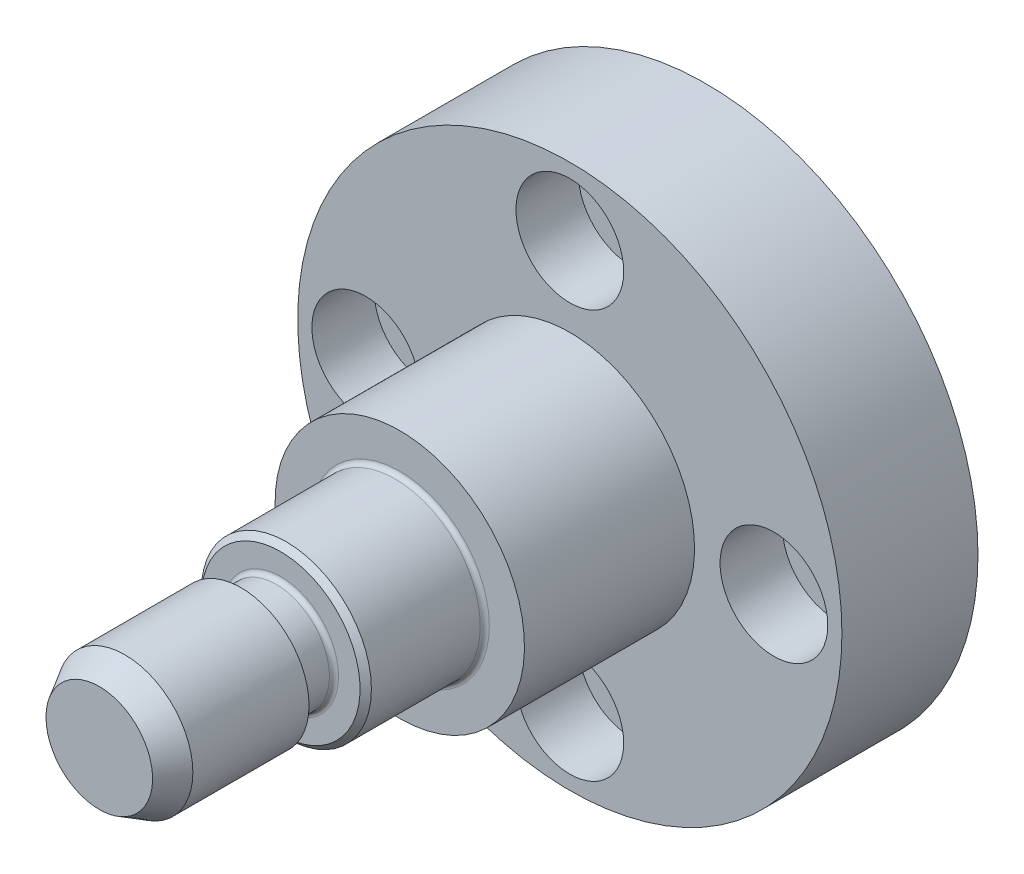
ISO-10303-21;
HEADER;
FILE_DESCRIPTION(('STEP AP214'),'2;1');
FILE_NAME('part.step','',(''),(''),'','','');
FILE_SCHEMA(('AUTOMOTIVE_DESIGN { 1 0 10303 214 1 1 1 1 }'));
ENDSEC;
DATA;
#1=APPLICATION_CONTEXT('core data for automotive mechanical design processes');
#2=APPLICATION_PROTOCOL_DEFINITION('international standard','automotive_design',2000,#1);
#3=PRODUCT_CONTEXT('',#1,'mechanical');
#4=PRODUCT('Part','Part','',(#3));
#5=PRODUCT_RELATED_PRODUCT_CATEGORY('part','',(#4));
#6=PRODUCT_DEFINITION_FORMATION('','',#4);
#7=PRODUCT_DEFINITION_CONTEXT('part definition',#1,'design');
#8=PRODUCT_DEFINITION('design','',#6,#7);
#9=PRODUCT_DEFINITION_SHAPE('','',#8);
#10=(LENGTH_UNIT() NAMED_UNIT(*) SI_UNIT(.MILLI.,.METRE.));
#11=(NAMED_UNIT(*) PLANE_ANGLE_UNIT() SI_UNIT($,.RADIAN.));
#12=(NAMED_UNIT(*) SI_UNIT($,.STERADIAN.) SOLID_ANGLE_UNIT());
#13=UNCERTAINTY_MEASURE_WITH_UNIT(LENGTH_MEASURE(1.E-05),#10,'distance_accuracy_value','');
#14=(GEOMETRIC_REPRESENTATION_CONTEXT(3) GLOBAL_UNCERTAINTY_ASSIGNED_CONTEXT((#13)) GLOBAL_UNIT_ASSIGNED_CONTEXT((#10,
#11,#12)) REPRESENTATION_CONTEXT('',''));
#15=CARTESIAN_POINT('',(0.,0.,0.));
#16=DIRECTION('',(0.,0.,1.));
#17=DIRECTION('',(1.,0.,0.));
#18=AXIS2_PLACEMENT_3D('',#15,#16,#17);
#19=CARTESIAN_POINT('',(-4.7564,-4.77276662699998,53.5));
#20=DIRECTION('',(0.,0.,1.));
#21=DIRECTION('',(1.,0.,0.));
#22=AXIS2_PLACEMENT_3D('',#19,#20,#21);
#23=PLANE('',#22);
#24=CARTESIAN_POINT('',(0.,0.,53.5));
#25=DIRECTION('',(0.,0.,-1.));
#26=DIRECTION('',(-1.,0.,0.));
#27=AXIS2_PLACEMENT_3D('',#24,#25,#26);
#28=CIRCLE('',#27,4.7);
#29=CARTESIAN_POINT('',(-4.7,0.,53.5));
#30=VERTEX_POINT('',#29);
#31=EDGE_CURVE('E16',#30,#30,#28,.T.);
#32=ORIENTED_EDGE('',*,*,#31,.F.);
#33=EDGE_LOOP('',(#32));
#34=FACE_BOUND('',#33,.T.);
#35=ADVANCED_FACE('F12',(#34),#23,.T.);
#36=CARTESIAN_POINT('',(0.,0.,53.5));
#37=DIRECTION('',(0.,0.,-1.));
#38=DIRECTION('',(-1.,0.,0.));
#39=AXIS2_PLACEMENT_3D('',#36,#37,#38);
#40=CONICAL_SURFACE('',#39,4.7,0.523598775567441);
#41=ORIENTED_EDGE('',*,*,#31,.T.);
#42=EDGE_LOOP('',(#41));
#43=FACE_BOUND('',#42,.T.);
#44=CARTESIAN_POINT('',(0.,0.,51.24833395));
#45=DIRECTION('',(0.,0.,1.));
#46=DIRECTION('',(1.,0.,0.));
#47=AXIS2_PLACEMENT_3D('',#44,#45,#46);
#48=CIRCLE('',#47,6.);
#49=CARTESIAN_POINT('',(6.,0.,51.24833395));
#50=VERTEX_POINT('',#49);
#51=EDGE_CURVE('E28',#50,#50,#48,.F.);
#52=ORIENTED_EDGE('',*,*,#51,.F.);
#53=EDGE_LOOP('',(#52));
#54=FACE_BOUND('',#53,.T.);
#55=ADVANCED_FACE('F108',(#43,#54),#40,.T.);
#56=CARTESIAN_POINT('',(0.,0.,41.));
#57=DIRECTION('',(0.,0.,1.));
#58=DIRECTION('',(1.,0.,0.));
#59=AXIS2_PLACEMENT_3D('',#56,#57,#58);
#60=CYLINDRICAL_SURFACE('',#59,6.);
#61=CARTESIAN_POINT('',(0.,0.,41.));
#62=DIRECTION('',(0.,0.,1.));
#63=DIRECTION('',(1.,0.,0.));
#64=AXIS2_PLACEMENT_3D('',#61,#62,#63);
#65=CIRCLE('',#64,6.);
#66=CARTESIAN_POINT('',(6.,0.,41.));
#67=VERTEX_POINT('',#66);
#68=EDGE_CURVE('E98',#67,#67,#65,.F.);
#69=ORIENTED_EDGE('',*,*,#68,.F.);
#70=EDGE_LOOP('',(#69));
#71=FACE_BOUND('',#70,.T.);
#72=ORIENTED_EDGE('',*,*,#51,.T.);
#73=EDGE_LOOP('',(#72));
#74=FACE_BOUND('',#73,.T.);
#75=ADVANCED_FACE('F118',(#71,#74),#60,.T.);
#76=CARTESIAN_POINT('',(6.072,-6.09289356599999,41.));
#77=DIRECTION('',(0.,0.,-1.));
#78=DIRECTION('',(-1.,0.,0.));
#79=AXIS2_PLACEMENT_3D('',#76,#77,#78);
#80=PLANE('',#79);
#81=CARTESIAN_POINT('',(0.,0.,41.));
#82=DIRECTION('',(0.,0.,1.));
#83=DIRECTION('',(1.,0.,0.));
#84=AXIS2_PLACEMENT_3D('',#81,#82,#83);
#85=CIRCLE('',#84,4.7);
#86=CARTESIAN_POINT('',(4.7,0.,41.));
#87=VERTEX_POINT('',#86);
#88=EDGE_CURVE('E96',#87,#87,#85,.F.);
#89=ORIENTED_EDGE('',*,*,#88,.F.);
#90=EDGE_LOOP('',(#89));
#91=FACE_BOUND('',#90,.T.);
#92=ORIENTED_EDGE('',*,*,#68,.T.);
#93=EDGE_LOOP('',(#92));
#94=FACE_BOUND('',#93,.T.);
#95=ADVANCED_FACE('F187',(#91,#94),#80,.T.);
#96=CARTESIAN_POINT('',(0.,0.,37.9));
#97=DIRECTION('',(0.,0.,1.));
#98=DIRECTION('',(1.,0.,0.));
#99=AXIS2_PLACEMENT_3D('',#96,#97,#98);
#100=CYLINDRICAL_SURFACE('',#99,4.7);
#101=CARTESIAN_POINT('',(0.,0.,37.9));
#102=DIRECTION('',(0.,0.,1.));
#103=DIRECTION('',(1.,0.,0.));
#104=AXIS2_PLACEMENT_3D('',#101,#102,#103);
#105=CIRCLE('',#104,4.7);
#106=CARTESIAN_POINT('',(4.7,0.,37.9));
#107=VERTEX_POINT('',#106);
#108=EDGE_CURVE('E95',#107,#107,#105,.T.);
#109=ORIENTED_EDGE('',*,*,#108,.T.);
#110=EDGE_LOOP('',(#109));
#111=FACE_BOUND('',#110,.T.);
#112=ORIENTED_EDGE('',*,*,#88,.T.);
#113=EDGE_LOOP('',(#112));
#114=FACE_BOUND('',#113,.T.);
#115=ADVANCED_FACE('F183',(#111,#114),#100,.T.);
#116=CARTESIAN_POINT('',(0.,0.,37.9));
#117=DIRECTION('',(0.,0.,1.));
#118=DIRECTION('',(1.,0.,0.));
#119=AXIS2_PLACEMENT_3D('',#116,#117,#118);
#120=TOROIDAL_SURFACE('',#119,5.1,0.4);
#121=CARTESIAN_POINT('',(0.,0.,37.5));
#122=DIRECTION('',(0.,0.,1.));
#123=DIRECTION('',(1.,0.,0.));
#124=AXIS2_PLACEMENT_3D('',#121,#122,#123);
#125=CIRCLE('',#124,5.100000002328);
#126=CARTESIAN_POINT('',(5.100000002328,0.,37.5));
#127=VERTEX_POINT('',#126);
#128=EDGE_CURVE('E92',#127,#127,#125,.F.);
#129=ORIENTED_EDGE('',*,*,#128,.F.);
#130=EDGE_LOOP('',(#129));
#131=FACE_BOUND('',#130,.T.);
#132=ORIENTED_EDGE('',*,*,#108,.F.);
#133=EDGE_LOOP('',(#132));
#134=FACE_BOUND('',#133,.T.);
#135=ADVANCED_FACE('F186',(#131,#134),#120,.F.);
#136=CARTESIAN_POINT('',(-7.084,-7.10837582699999,37.5));
#137=DIRECTION('',(0.,0.,1.));
#138=DIRECTION('',(1.,0.,0.));
#139=AXIS2_PLACEMENT_3D('',#136,#137,#138);
#140=PLANE('',#139);
#141=ORIENTED_EDGE('',*,*,#128,.T.);
#142=EDGE_LOOP('',(#141));
#143=FACE_BOUND('',#142,.T.);
#144=CARTESIAN_POINT('',(0.,0.,37.5));
#145=DIRECTION('',(0.,0.,-1.));
#146=DIRECTION('',(-1.,0.,0.));
#147=AXIS2_PLACEMENT_3D('',#144,#145,#146);
#148=CIRCLE('',#147,7.);
#149=CARTESIAN_POINT('',(-7.,0.,37.5));
#150=VERTEX_POINT('',#149);
#151=EDGE_CURVE('E88',#150,#150,#148,.T.);
#152=ORIENTED_EDGE('',*,*,#151,.F.);
#153=EDGE_LOOP('',(#152));
#154=FACE_BOUND('',#153,.T.);
#155=ADVANCED_FACE('F181',(#143,#154),#140,.T.);
#156=CARTESIAN_POINT('',(0.,0.,37.5));
#157=DIRECTION('',(0.,0.,-1.));
#158=DIRECTION('',(-1.,0.,0.));
#159=AXIS2_PLACEMENT_3D('',#156,#157,#158);
#160=CONICAL_SURFACE('',#159,7.,0.785398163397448);
#161=ORIENTED_EDGE('',*,*,#151,.T.);
#162=EDGE_LOOP('',(#161));
#163=FACE_BOUND('',#162,.T.);
#164=CARTESIAN_POINT('',(0.,0.,37.));
#165=DIRECTION('',(0.,0.,1.));
#166=DIRECTION('',(1.,0.,0.));
#167=AXIS2_PLACEMENT_3D('',#164,#165,#166);
#168=CIRCLE('',#167,7.5);
#169=CARTESIAN_POINT('',(7.5,0.,37.));
#170=VERTEX_POINT('',#169);
#171=EDGE_CURVE('E91',#170,#170,#168,.F.);
#172=ORIENTED_EDGE('',*,*,#171,.F.);
#173=EDGE_LOOP('',(#172));
#174=FACE_BOUND('',#173,.T.);
#175=ADVANCED_FACE('F177',(#163,#174),#160,.T.);
#176=CARTESIAN_POINT('',(0.,0.,27.4));
#177=DIRECTION('',(0.,0.,1.));
#178=DIRECTION('',(0.,-1.,0.));
#179=AXIS2_PLACEMENT_3D('',#176,#177,#178);
#180=CYLINDRICAL_SURFACE('',#179,7.5);
#181=CARTESIAN_POINT('',(0.,0.,27.4));
#182=DIRECTION('',(0.,0.,1.));
#183=DIRECTION('',(1.,0.,0.));
#184=AXIS2_PLACEMENT_3D('',#181,#182,#183);
#185=CIRCLE('',#184,7.5);
#186=CARTESIAN_POINT('',(7.5,0.,27.4));
#187=VERTEX_POINT('',#186);
#188=EDGE_CURVE('E87',#187,#187,#185,.T.);
#189=ORIENTED_EDGE('',*,*,#188,.T.);
#190=EDGE_LOOP('',(#189));
#191=FACE_BOUND('',#190,.T.);
#192=ORIENTED_EDGE('',*,*,#171,.T.);
#193=EDGE_LOOP('',(#192));
#194=FACE_BOUND('',#193,.T.);
#195=ADVANCED_FACE('F173',(#191,#194),#180,.T.);
#196=CARTESIAN_POINT('',(0.,0.,27.4));
#197=DIRECTION('',(0.,0.,1.));
#198=DIRECTION('',(1.,0.,0.));
#199=AXIS2_PLACEMENT_3D('',#196,#197,#198);
#200=TOROIDAL_SURFACE('',#199,7.9,0.4);
#201=CARTESIAN_POINT('',(0.,0.,27.));
#202=DIRECTION('',(0.,0.,1.));
#203=DIRECTION('',(1.,0.,0.));
#204=AXIS2_PLACEMENT_3D('',#201,#202,#203);
#205=CIRCLE('',#204,7.899999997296);
#206=CARTESIAN_POINT('',(7.899999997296,0.,27.));
#207=VERTEX_POINT('',#206);
#208=EDGE_CURVE('E84',#207,#207,#205,.F.);
#209=ORIENTED_EDGE('',*,*,#208,.F.);
#210=EDGE_LOOP('',(#209));
#211=FACE_BOUND('',#210,.T.);
#212=ORIENTED_EDGE('',*,*,#188,.F.);
#213=EDGE_LOOP('',(#212));
#214=FACE_BOUND('',#213,.T.);
#215=ADVANCED_FACE('F176',(#211,#214),#200,.F.);
#216=CARTESIAN_POINT('',(-11.132,-11.170304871,27.));
#217=DIRECTION('',(0.,0.,1.));
#218=DIRECTION('',(1.,0.,0.));
#219=AXIS2_PLACEMENT_3D('',#216,#217,#218);
#220=PLANE('',#219);
#221=ORIENTED_EDGE('',*,*,#208,.T.);
#222=EDGE_LOOP('',(#221));
#223=FACE_BOUND('',#222,.T.);
#224=CARTESIAN_POINT('',(0.,0.,27.));
#225=DIRECTION('',(0.,0.,1.));
#226=DIRECTION('',(0.,-1.,0.));
#227=AXIS2_PLACEMENT_3D('',#224,#225,#226);
#228=CIRCLE('',#227,11.);
#229=CARTESIAN_POINT('',(0.,-11.,27.));
#230=VERTEX_POINT('',#229);
#231=EDGE_CURVE('E81',#230,#230,#228,.F.);
#232=ORIENTED_EDGE('',*,*,#231,.F.);
#233=EDGE_LOOP('',(#232));
#234=FACE_BOUND('',#233,.T.);
#235=ADVANCED_FACE('F171',(#223,#234),#220,.T.);
#236=CARTESIAN_POINT('',(0.,0.,12.));
#237=DIRECTION('',(0.,0.,1.));
#238=DIRECTION('',(0.,-1.,0.));
#239=AXIS2_PLACEMENT_3D('',#236,#237,#238);
#240=CYLINDRICAL_SURFACE('',#239,11.);
#241=CARTESIAN_POINT('',(0.,0.,12.));
#242=DIRECTION('',(0.,0.,1.));
#243=DIRECTION('',(0.,-1.,0.));
#244=AXIS2_PLACEMENT_3D('',#241,#242,#243);
#245=CIRCLE('',#244,11.);
#246=CARTESIAN_POINT('',(0.,-11.,12.));
#247=VERTEX_POINT('',#246);
#248=EDGE_CURVE('E69',#247,#247,#245,.F.);
#249=ORIENTED_EDGE('',*,*,#248,.F.);
#250=EDGE_LOOP('',(#249));
#251=FACE_BOUND('',#250,.T.);
#252=ORIENTED_EDGE('',*,*,#231,.T.);
#253=EDGE_LOOP('',(#252));
#254=FACE_BOUND('',#253,.T.);
#255=ADVANCED_FACE('F167',(#251,#254),#240,.T.);
#256=CARTESIAN_POINT('',(0.,-18.,6.5));
#257=DIRECTION('',(0.,0.,1.));
#258=DIRECTION('',(1.,0.,0.));
#259=AXIS2_PLACEMENT_3D('',#256,#257,#258);
#260=CYLINDRICAL_SURFACE('',#259,4.75);
#261=CARTESIAN_POINT('',(0.,-18.,6.5));
#262=DIRECTION('',(0.,0.,1.));
#263=DIRECTION('',(1.,0.,0.));
#264=AXIS2_PLACEMENT_3D('',#261,#262,#263);
#265=CIRCLE('',#264,4.75);
#266=CARTESIAN_POINT('',(4.75,-18.,6.5));
#267=VERTEX_POINT('',#266);
#268=EDGE_CURVE('E66',#267,#267,#265,.F.);
#269=ORIENTED_EDGE('',*,*,#268,.T.);
#270=EDGE_LOOP('',(#269));
#271=FACE_BOUND('',#270,.T.);
#272=CARTESIAN_POINT('',(0.,-18.,12.));
#273=DIRECTION('',(0.,0.,1.));
#274=DIRECTION('',(1.,0.,0.));
#275=AXIS2_PLACEMENT_3D('',#272,#273,#274);
#276=CIRCLE('',#275,4.75);
#277=CARTESIAN_POINT('',(4.75,-18.,12.));
#278=VERTEX_POINT('',#277);
#279=EDGE_CURVE('E78',#278,#278,#276,.F.);
#280=ORIENTED_EDGE('',*,*,#279,.F.);
#281=EDGE_LOOP('',(#280));
#282=FACE_BOUND('',#281,.T.);
#283=ADVANCED_FACE('F163',(#271,#282),#260,.F.);
#284=CARTESIAN_POINT('',(-18.,0.,6.5));
#285=DIRECTION('',(0.,0.,1.));
#286=DIRECTION('',(1.,0.,0.));
#287=AXIS2_PLACEMENT_3D('',#284,#285,#286);
#288=CYLINDRICAL_SURFACE('',#287,4.75);
#289=CARTESIAN_POINT('',(-18.,0.,6.5));
#290=DIRECTION('',(0.,0.,1.));
#291=DIRECTION('',(1.,0.,0.));
#292=AXIS2_PLACEMENT_3D('',#289,#290,#291);
#293=CIRCLE('',#292,4.75);
#294=CARTESIAN_POINT('',(-13.25,0.,6.5));
#295=VERTEX_POINT('',#294);
#296=EDGE_CURVE('E63',#295,#295,#293,.F.);
#297=ORIENTED_EDGE('',*,*,#296,.T.);
#298=EDGE_LOOP('',(#297));
#299=FACE_BOUND('',#298,.T.);
#300=CARTESIAN_POINT('',(-18.,0.,12.));
#301=DIRECTION('',(0.,0.,1.));
#302=DIRECTION('',(1.,0.,0.));
#303=AXIS2_PLACEMENT_3D('',#300,#301,#302);
#304=CIRCLE('',#303,4.75);
#305=CARTESIAN_POINT('',(-13.25,0.,12.));
#306=VERTEX_POINT('',#305);
#307=EDGE_CURVE('E75',#306,#306,#304,.F.);
#308=ORIENTED_EDGE('',*,*,#307,.F.);
#309=EDGE_LOOP('',(#308));
#310=FACE_BOUND('',#309,.T.);
#311=ADVANCED_FACE('F159',(#299,#310),#288,.F.);
#312=CARTESIAN_POINT('',(0.,18.,6.5));
#313=DIRECTION('',(0.,0.,1.));
#314=DIRECTION('',(1.,0.,0.));
#315=AXIS2_PLACEMENT_3D('',#312,#313,#314);
#316=CYLINDRICAL_SURFACE('',#315,4.75);
#317=CARTESIAN_POINT('',(0.,18.,6.5));
#318=DIRECTION('',(0.,0.,1.));
#319=DIRECTION('',(1.,0.,0.));
#320=AXIS2_PLACEMENT_3D('',#317,#318,#319);
#321=CIRCLE('',#320,4.75);
#322=CARTESIAN_POINT('',(4.75,18.,6.5));
#323=VERTEX_POINT('',#322);
#324=EDGE_CURVE('E60',#323,#323,#321,.F.);
#325=ORIENTED_EDGE('',*,*,#324,.T.);
#326=EDGE_LOOP('',(#325));
#327=FACE_BOUND('',#326,.T.);
#328=CARTESIAN_POINT('',(0.,18.,12.));
#329=DIRECTION('',(0.,0.,1.));
#330=DIRECTION('',(1.,0.,0.));
#331=AXIS2_PLACEMENT_3D('',#328,#329,#330);
#332=CIRCLE('',#331,4.75);
#333=CARTESIAN_POINT('',(4.75,18.,12.));
#334=VERTEX_POINT('',#333);
#335=EDGE_CURVE('E72',#334,#334,#332,.F.);
#336=ORIENTED_EDGE('',*,*,#335,.F.);
#337=EDGE_LOOP('',(#336));
#338=FACE_BOUND('',#337,.T.);
#339=ADVANCED_FACE('F155',(#327,#338),#316,.F.);
#340=CARTESIAN_POINT('',(-24.288,-24.371574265,12.));
#341=DIRECTION('',(0.,0.,1.));
#342=DIRECTION('',(1.,0.,0.));
#343=AXIS2_PLACEMENT_3D('',#340,#341,#342);
#344=PLANE('',#343);
#345=ORIENTED_EDGE('',*,*,#248,.T.);
#346=EDGE_LOOP('',(#345));
#347=FACE_BOUND('',#346,.T.);
#348=ORIENTED_EDGE('',*,*,#335,.T.);
#349=EDGE_LOOP('',(#348));
#350=FACE_BOUND('',#349,.T.);
#351=ORIENTED_EDGE('',*,*,#307,.T.);
#352=EDGE_LOOP('',(#351));
#353=FACE_BOUND('',#352,.T.);
#354=ORIENTED_EDGE('',*,*,#279,.T.);
#355=EDGE_LOOP('',(#354));
#356=FACE_BOUND('',#355,.T.);
#357=CARTESIAN_POINT('',(18.,0.,12.));
#358=DIRECTION('',(0.,0.,1.));
#359=DIRECTION('',(1.,0.,0.));
#360=AXIS2_PLACEMENT_3D('',#357,#358,#359);
#361=CIRCLE('',#360,4.75);
#362=CARTESIAN_POINT('',(22.75,0.,12.));
#363=VERTEX_POINT('',#362);
#364=EDGE_CURVE('E57',#363,#363,#361,.F.);
#365=ORIENTED_EDGE('',*,*,#364,.T.);
#366=EDGE_LOOP('',(#365));
#367=FACE_BOUND('',#366,.T.);
#368=CARTESIAN_POINT('',(0.,0.,12.));
#369=DIRECTION('',(0.,0.,1.));
#370=DIRECTION('',(1.,0.,0.));
#371=AXIS2_PLACEMENT_3D('',#368,#369,#370);
#372=CIRCLE('',#371,24.);
#373=CARTESIAN_POINT('',(24.,0.,12.));
#374=VERTEX_POINT('',#373);
#375=EDGE_CURVE('E54',#374,#374,#372,.F.);
#376=ORIENTED_EDGE('',*,*,#375,.F.);
#377=EDGE_LOOP('',(#376));
#378=FACE_BOUND('',#377,.T.);
#379=ADVANCED_FACE('F158',(#347,#350,#353,#356,#367,#378),#344,.T.);
#380=CARTESIAN_POINT('',(-4.807,-13.17645926,6.5));
#381=DIRECTION('',(0.,0.,-1.));
#382=DIRECTION('',(1.,0.,0.));
#383=AXIS2_PLACEMENT_3D('',#380,#381,#382);
#384=PLANE('',#383);
#385=CARTESIAN_POINT('',(0.,-18.,6.5));
#386=DIRECTION('',(0.,0.,1.));
#387=DIRECTION('',(1.,0.,0.));
#388=AXIS2_PLACEMENT_3D('',#385,#386,#387);
#389=CIRCLE('',#388,3.);
#390=CARTESIAN_POINT('',(3.,-18.,6.5));
#391=VERTEX_POINT('',#390);
#392=EDGE_CURVE('E51',#391,#391,#389,.F.);
#393=ORIENTED_EDGE('',*,*,#392,.T.);
#394=EDGE_LOOP('',(#393));
#395=FACE_BOUND('',#394,.T.);
#396=ORIENTED_EDGE('',*,*,#268,.F.);
#397=EDGE_LOOP('',(#396));
#398=FACE_BOUND('',#397,.T.);
#399=ADVANCED_FACE('F215',(#395,#398),#384,.F.);
#400=CARTESIAN_POINT('',(-13.17645926,4.807,6.5));
#401=DIRECTION('',(0.,0.,-1.));
#402=DIRECTION('',(0.,-1.,0.));
#403=AXIS2_PLACEMENT_3D('',#400,#401,#402);
#404=PLANE('',#403);
#405=CARTESIAN_POINT('',(-18.,0.,6.5));
#406=DIRECTION('',(0.,0.,1.));
#407=DIRECTION('',(1.,0.,0.));
#408=AXIS2_PLACEMENT_3D('',#405,#406,#407);
#409=CIRCLE('',#408,3.);
#410=CARTESIAN_POINT('',(-15.,0.,6.5));
#411=VERTEX_POINT('',#410);
#412=EDGE_CURVE('E48',#411,#411,#409,.F.);
#413=ORIENTED_EDGE('',*,*,#412,.T.);
#414=EDGE_LOOP('',(#413));
#415=FACE_BOUND('',#414,.T.);
#416=ORIENTED_EDGE('',*,*,#296,.F.);
#417=EDGE_LOOP('',(#416));
#418=FACE_BOUND('',#417,.T.);
#419=ADVANCED_FACE('F219',(#415,#418),#404,.F.);
#420=CARTESIAN_POINT('',(4.807,13.17645926,6.5));
#421=DIRECTION('',(0.,0.,-1.));
#422=DIRECTION('',(-1.,0.,0.));
#423=AXIS2_PLACEMENT_3D('',#420,#421,#422);
#424=PLANE('',#423);
#425=CARTESIAN_POINT('',(0.,18.,6.5));
#426=DIRECTION('',(0.,0.,1.));
#427=DIRECTION('',(1.,0.,0.));
#428=AXIS2_PLACEMENT_3D('',#425,#426,#427);
#429=CIRCLE('',#428,3.);
#430=CARTESIAN_POINT('',(3.,18.,6.5));
#431=VERTEX_POINT('',#430);
#432=EDGE_CURVE('E45',#431,#431,#429,.F.);
#433=ORIENTED_EDGE('',*,*,#432,.T.);
#434=EDGE_LOOP('',(#433));
#435=FACE_BOUND('',#434,.T.);
#436=ORIENTED_EDGE('',*,*,#324,.F.);
#437=EDGE_LOOP('',(#436));
#438=FACE_BOUND('',#437,.T.);
#439=ADVANCED_FACE('F153',(#435,#438),#424,.F.);
#440=CARTESIAN_POINT('',(18.,0.,6.5));
#441=DIRECTION('',(0.,0.,1.));
#442=DIRECTION('',(1.,0.,0.));
#443=AXIS2_PLACEMENT_3D('',#440,#441,#442);
#444=CYLINDRICAL_SURFACE('',#443,4.75);
#445=CARTESIAN_POINT('',(18.,0.,6.5));
#446=DIRECTION('',(0.,0.,1.));
#447=DIRECTION('',(1.,0.,0.));
#448=AXIS2_PLACEMENT_3D('',#445,#446,#447);
#449=CIRCLE('',#448,4.75);
#450=CARTESIAN_POINT('',(22.75,0.,6.5));
#451=VERTEX_POINT('',#450);
#452=EDGE_CURVE('E42',#451,#451,#449,.F.);
#453=ORIENTED_EDGE('',*,*,#452,.T.);
#454=EDGE_LOOP('',(#453));
#455=FACE_BOUND('',#454,.T.);
#456=ORIENTED_EDGE('',*,*,#364,.F.);
#457=EDGE_LOOP('',(#456));
#458=FACE_BOUND('',#457,.T.);
#459=ADVANCED_FACE('F149',(#455,#458),#444,.F.);
#460=CARTESIAN_POINT('',(0.,0.,0.));
#461=DIRECTION('',(0.,0.,1.));
#462=DIRECTION('',(1.,0.,0.));
#463=AXIS2_PLACEMENT_3D('',#460,#461,#462);
#464=CYLINDRICAL_SURFACE('',#463,24.);
#465=CARTESIAN_POINT('',(0.,0.,0.));
#466=DIRECTION('',(0.,0.,1.));
#467=DIRECTION('',(1.,0.,0.));
#468=AXIS2_PLACEMENT_3D('',#465,#466,#467);
#469=CIRCLE('',#468,24.);
#470=CARTESIAN_POINT('',(24.,0.,0.));
#471=VERTEX_POINT('',#470);
#472=EDGE_CURVE('E39',#471,#471,#469,.F.);
#473=ORIENTED_EDGE('',*,*,#472,.F.);
#474=EDGE_LOOP('',(#473));
#475=FACE_BOUND('',#474,.T.);
#476=ORIENTED_EDGE('',*,*,#375,.T.);
#477=EDGE_LOOP('',(#476));
#478=FACE_BOUND('',#477,.T.);
#479=ADVANCED_FACE('F145',(#475,#478),#464,.T.);
#480=CARTESIAN_POINT('',(0.,-18.,0.));
#481=DIRECTION('',(0.,0.,1.));
#482=DIRECTION('',(1.,0.,0.));
#483=AXIS2_PLACEMENT_3D('',#480,#481,#482);
#484=CYLINDRICAL_SURFACE('',#483,3.);
#485=ORIENTED_EDGE('',*,*,#392,.F.);
#486=EDGE_LOOP('',(#485));
#487=FACE_BOUND('',#486,.T.);
#488=CARTESIAN_POINT('',(0.,-18.,0.));
#489=DIRECTION('',(0.,0.,1.));
#490=DIRECTION('',(1.,0.,0.));
#491=AXIS2_PLACEMENT_3D('',#488,#489,#490);
#492=CIRCLE('',#491,3.);
#493=CARTESIAN_POINT('',(3.,-18.,0.));
#494=VERTEX_POINT('',#493);
#495=EDGE_CURVE('E36',#494,#494,#492,.T.);
#496=ORIENTED_EDGE('',*,*,#495,.F.);
#497=EDGE_LOOP('',(#496));
#498=FACE_BOUND('',#497,.T.);
#499=ADVANCED_FACE('F141',(#487,#498),#484,.F.);
#500=CARTESIAN_POINT('',(-18.,0.,0.));
#501=DIRECTION('',(0.,0.,1.));
#502=DIRECTION('',(1.,0.,0.));
#503=AXIS2_PLACEMENT_3D('',#500,#501,#502);
#504=CYLINDRICAL_SURFACE('',#503,3.);
#505=ORIENTED_EDGE('',*,*,#412,.F.);
#506=EDGE_LOOP('',(#505));
#507=FACE_BOUND('',#506,.T.);
#508=CARTESIAN_POINT('',(-18.,0.,0.));
#509=DIRECTION('',(0.,0.,1.));
#510=DIRECTION('',(1.,0.,0.));
#511=AXIS2_PLACEMENT_3D('',#508,#509,#510);
#512=CIRCLE('',#511,3.);
#513=CARTESIAN_POINT('',(-15.,0.,0.));
#514=VERTEX_POINT('',#513);
#515=EDGE_CURVE('E33',#514,#514,#512,.T.);
#516=ORIENTED_EDGE('',*,*,#515,.F.);
#517=EDGE_LOOP('',(#516));
#518=FACE_BOUND('',#517,.T.);
#519=ADVANCED_FACE('F137',(#507,#518),#504,.F.);
#520=CARTESIAN_POINT('',(0.,18.,0.));
#521=DIRECTION('',(0.,0.,1.));
#522=DIRECTION('',(1.,0.,0.));
#523=AXIS2_PLACEMENT_3D('',#520,#521,#522);
#524=CYLINDRICAL_SURFACE('',#523,3.);
#525=ORIENTED_EDGE('',*,*,#432,.F.);
#526=EDGE_LOOP('',(#525));
#527=FACE_BOUND('',#526,.T.);
#528=CARTESIAN_POINT('',(0.,18.,0.));
#529=DIRECTION('',(0.,0.,1.));
#530=DIRECTION('',(1.,0.,0.));
#531=AXIS2_PLACEMENT_3D('',#528,#529,#530);
#532=CIRCLE('',#531,3.);
#533=CARTESIAN_POINT('',(3.,18.,0.));
#534=VERTEX_POINT('',#533);
#535=EDGE_CURVE('E25',#534,#534,#532,.T.);
#536=ORIENTED_EDGE('',*,*,#535,.F.);
#537=EDGE_LOOP('',(#536));
#538=FACE_BOUND('',#537,.T.);
#539=ADVANCED_FACE('F134',(#527,#538),#524,.F.);
#540=CARTESIAN_POINT('',(13.17645926,-4.807,6.5));
#541=DIRECTION('',(0.,0.,-1.));
#542=DIRECTION('',(0.,1.,0.));
#543=AXIS2_PLACEMENT_3D('',#540,#541,#542);
#544=PLANE('',#543);
#545=CARTESIAN_POINT('',(18.,0.,6.5));
#546=DIRECTION('',(0.,0.,1.));
#547=DIRECTION('',(1.,0.,0.));
#548=AXIS2_PLACEMENT_3D('',#545,#546,#547);
#549=CIRCLE('',#548,3.);
#550=CARTESIAN_POINT('',(21.,0.,6.5));
#551=VERTEX_POINT('',#550);
#552=EDGE_CURVE('E20',#551,#551,#549,.F.);
#553=ORIENTED_EDGE('',*,*,#552,.T.);
#554=EDGE_LOOP('',(#553));
#555=FACE_BOUND('',#554,.T.);
#556=ORIENTED_EDGE('',*,*,#452,.F.);
#557=EDGE_LOOP('',(#556));
#558=FACE_BOUND('',#557,.T.);
#559=ADVANCED_FACE('F129',(#555,#558),#544,.F.);
#560=CARTESIAN_POINT('',(24.288,-24.371574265,0.));
#561=DIRECTION('',(0.,0.,-1.));
#562=DIRECTION('',(-1.,0.,0.));
#563=AXIS2_PLACEMENT_3D('',#560,#561,#562);
#564=PLANE('',#563);
#565=ORIENTED_EDGE('',*,*,#535,.T.);
#566=EDGE_LOOP('',(#565));
#567=FACE_BOUND('',#566,.T.);
#568=ORIENTED_EDGE('',*,*,#515,.T.);
#569=EDGE_LOOP('',(#568));
#570=FACE_BOUND('',#569,.T.);
#571=ORIENTED_EDGE('',*,*,#495,.T.);
#572=EDGE_LOOP('',(#571));
#573=FACE_BOUND('',#572,.T.);
#574=CARTESIAN_POINT('',(18.,0.,0.));
#575=DIRECTION('',(0.,0.,1.));
#576=DIRECTION('',(1.,0.,0.));
#577=AXIS2_PLACEMENT_3D('',#574,#575,#576);
#578=CIRCLE('',#577,3.);
#579=CARTESIAN_POINT('',(21.,0.,0.));
#580=VERTEX_POINT('',#579);
#581=EDGE_CURVE('E8',#580,#580,#578,.T.);
#582=ORIENTED_EDGE('',*,*,#581,.T.);
#583=EDGE_LOOP('',(#582));
#584=FACE_BOUND('',#583,.T.);
#585=ORIENTED_EDGE('',*,*,#472,.T.);
#586=EDGE_LOOP('',(#585));
#587=FACE_BOUND('',#586,.T.);
#588=ADVANCED_FACE('F14',(#567,#570,#573,#584,#587),#564,.T.);
#589=CARTESIAN_POINT('',(18.,0.,0.));
#590=DIRECTION('',(0.,0.,1.));
#591=DIRECTION('',(1.,0.,0.));
#592=AXIS2_PLACEMENT_3D('',#589,#590,#591);
#593=CYLINDRICAL_SURFACE('',#592,3.);
#594=ORIENTED_EDGE('',*,*,#552,.F.);
#595=EDGE_LOOP('',(#594));
#596=FACE_BOUND('',#595,.T.);
#597=ORIENTED_EDGE('',*,*,#581,.F.);
#598=EDGE_LOOP('',(#597));
#599=FACE_BOUND('',#598,.T.);
#600=ADVANCED_FACE('F122',(#596,#599),#593,.F.);
#601=CLOSED_SHELL('',(#35,#55,#75,#95,#115,#135,#155,#175,#195,#215,#235,#255,#283,#311,#339,
#379,#399,#419,#439,#459,#479,#499,#519,#539,#559,#588,#600));
#602=MANIFOLD_SOLID_BREP('B1',#601);
#603=ADVANCED_BREP_SHAPE_REPRESENTATION('',(#18,#602),#14);
#604=SHAPE_DEFINITION_REPRESENTATION(#9,#603);
ENDSEC;
END-ISO-10303-21;
